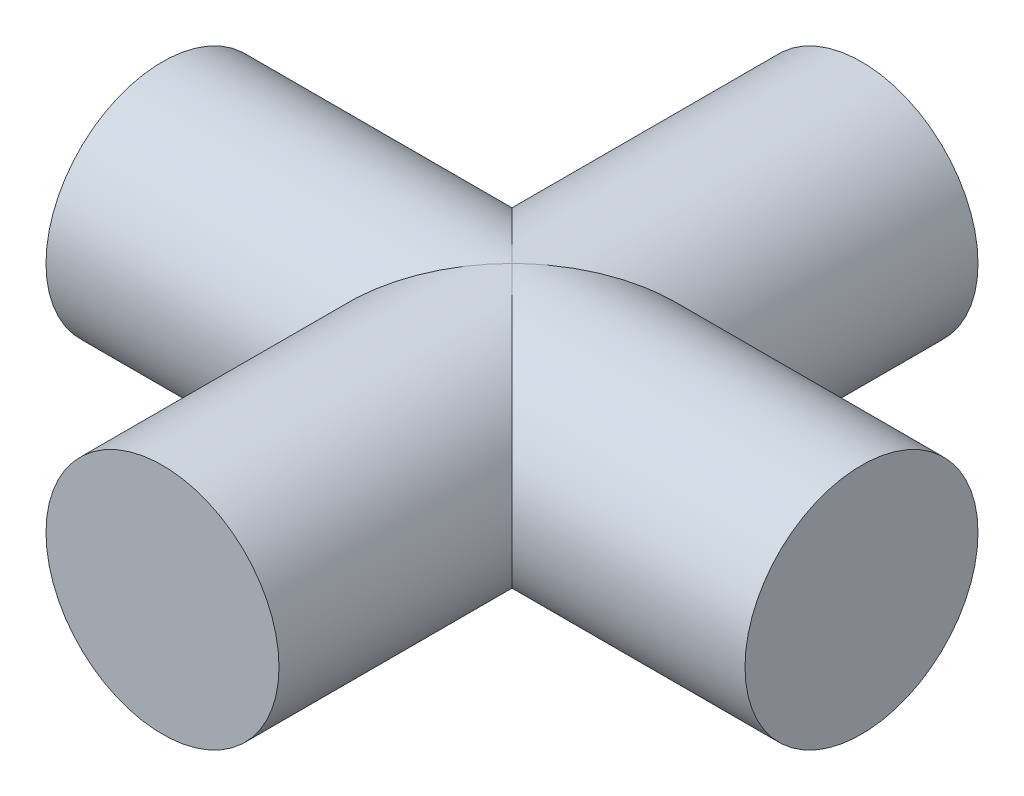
ISO-10303-21;
HEADER;
FILE_DESCRIPTION(('STEP AP214'),'2;1');
FILE_NAME('part.step','',(''),(''),'','','');
FILE_SCHEMA(('AUTOMOTIVE_DESIGN { 1 0 10303 214 1 1 1 1 }'));
ENDSEC;
DATA;
#1=APPLICATION_CONTEXT('core data for automotive mechanical design processes');
#2=APPLICATION_PROTOCOL_DEFINITION('international standard','automotive_design',2000,#1);
#3=PRODUCT_CONTEXT('',#1,'mechanical');
#4=PRODUCT('Part','Part','',(#3));
#5=PRODUCT_RELATED_PRODUCT_CATEGORY('part','',(#4));
#6=PRODUCT_DEFINITION_FORMATION('','',#4);
#7=PRODUCT_DEFINITION_CONTEXT('part definition',#1,'design');
#8=PRODUCT_DEFINITION('design','',#6,#7);
#9=PRODUCT_DEFINITION_SHAPE('','',#8);
#10=(LENGTH_UNIT() NAMED_UNIT(*) SI_UNIT(.MILLI.,.METRE.));
#11=(NAMED_UNIT(*) PLANE_ANGLE_UNIT() SI_UNIT($,.RADIAN.));
#12=(NAMED_UNIT(*) SI_UNIT($,.STERADIAN.) SOLID_ANGLE_UNIT());
#13=UNCERTAINTY_MEASURE_WITH_UNIT(LENGTH_MEASURE(1.E-05),#10,'distance_accuracy_value','');
#14=(GEOMETRIC_REPRESENTATION_CONTEXT(3) GLOBAL_UNCERTAINTY_ASSIGNED_CONTEXT((#13)) GLOBAL_UNIT_ASSIGNED_CONTEXT((#10,
#11,#12)) REPRESENTATION_CONTEXT('',''));
#15=CARTESIAN_POINT('',(0.,0.,0.));
#16=DIRECTION('',(0.,0.,1.));
#17=DIRECTION('',(1.,0.,0.));
#18=AXIS2_PLACEMENT_3D('',#15,#16,#17);
#19=CARTESIAN_POINT('',(-19.05,0.,0.));
#20=DIRECTION('',(1.,0.,0.));
#21=DIRECTION('',(0.,0.,-1.));
#22=AXIS2_PLACEMENT_3D('',#19,#20,#21);
#23=CYLINDRICAL_SURFACE('',#22,6.35);
#24=CARTESIAN_POINT('',(0.,0.,0.));
#25=DIRECTION('',(0.707106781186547,0.,0.707106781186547));
#26=DIRECTION('',(0.707106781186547,0.,-0.707106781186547));
#27=AXIS2_PLACEMENT_3D('',#24,#25,#26);
#28=ELLIPSE('',#27,8.98025612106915,6.35);
#29=CARTESIAN_POINT('',(0.,6.35,0.));
#30=VERTEX_POINT('',#29);
#31=CARTESIAN_POINT('',(0.,-6.35,0.));
#32=VERTEX_POINT('',#31);
#33=EDGE_CURVE('E56',#30,#32,#28,.T.);
#34=ORIENTED_EDGE('',*,*,#33,.F.);
#35=CARTESIAN_POINT('',(0.,0.,0.));
#36=DIRECTION('',(0.707106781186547,0.,-0.707106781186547));
#37=DIRECTION('',(0.707106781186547,0.,0.707106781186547));
#38=AXIS2_PLACEMENT_3D('',#35,#36,#37);
#39=ELLIPSE('',#38,8.98025612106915,6.35);
#40=EDGE_CURVE('E68',#32,#30,#39,.T.);
#41=ORIENTED_EDGE('',*,*,#40,.F.);
#42=EDGE_LOOP('',(#34,#41));
#43=FACE_BOUND('',#42,.T.);
#44=CARTESIAN_POINT('',(-19.05,0.,0.));
#45=DIRECTION('',(1.,0.,0.));
#46=DIRECTION('',(0.,0.,-1.));
#47=AXIS2_PLACEMENT_3D('',#44,#45,#46);
#48=CIRCLE('',#47,6.35);
#49=CARTESIAN_POINT('',(-19.05,0.,-6.35));
#50=VERTEX_POINT('',#49);
#51=EDGE_CURVE('E75',#50,#50,#48,.T.);
#52=ORIENTED_EDGE('',*,*,#51,.T.);
#53=EDGE_LOOP('',(#52));
#54=FACE_BOUND('',#53,.T.);
#55=ADVANCED_FACE('F49',(#43,#54),#23,.T.);
#56=CARTESIAN_POINT('',(-19.05,0.,0.));
#57=DIRECTION('',(1.,0.,0.));
#58=DIRECTION('',(0.,0.,-1.));
#59=AXIS2_PLACEMENT_3D('',#56,#57,#58);
#60=PLANE('',#59);
#61=ORIENTED_EDGE('',*,*,#51,.F.);
#62=EDGE_LOOP('',(#61));
#63=FACE_BOUND('',#62,.T.);
#64=ADVANCED_FACE('F98',(#63),#60,.F.);
#65=CARTESIAN_POINT('',(0.,0.,19.05));
#66=DIRECTION('',(0.,0.,1.));
#67=DIRECTION('',(1.,0.,0.));
#68=AXIS2_PLACEMENT_3D('',#65,#66,#67);
#69=PLANE('',#68);
#70=CARTESIAN_POINT('',(0.,0.,19.05));
#71=DIRECTION('',(0.,0.,1.));
#72=DIRECTION('',(1.,0.,0.));
#73=AXIS2_PLACEMENT_3D('',#70,#71,#72);
#74=CIRCLE('',#73,6.35);
#75=CARTESIAN_POINT('',(6.35,0.,19.05));
#76=VERTEX_POINT('',#75);
#77=EDGE_CURVE('E88',#76,#76,#74,.T.);
#78=ORIENTED_EDGE('',*,*,#77,.T.);
#79=EDGE_LOOP('',(#78));
#80=FACE_BOUND('',#79,.T.);
#81=ADVANCED_FACE('F100',(#80),#69,.T.);
#82=CARTESIAN_POINT('',(0.,0.,-19.05));
#83=DIRECTION('',(0.,0.,1.));
#84=DIRECTION('',(1.,0.,0.));
#85=AXIS2_PLACEMENT_3D('',#82,#83,#84);
#86=CYLINDRICAL_SURFACE('',#85,6.35);
#87=ORIENTED_EDGE('',*,*,#77,.F.);
#88=EDGE_LOOP('',(#87));
#89=FACE_BOUND('',#88,.T.);
#90=CARTESIAN_POINT('',(0.,0.,0.));
#91=DIRECTION('',(0.707106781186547,0.,-0.707106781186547));
#92=DIRECTION('',(0.707106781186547,0.,0.707106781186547));
#93=AXIS2_PLACEMENT_3D('',#90,#91,#92);
#94=ELLIPSE('',#93,8.98025612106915,6.35);
#95=EDGE_CURVE('E62',#32,#30,#94,.F.);
#96=ORIENTED_EDGE('',*,*,#95,.T.);
#97=ORIENTED_EDGE('',*,*,#33,.T.);
#98=EDGE_LOOP('',(#96,#97));
#99=FACE_BOUND('',#98,.T.);
#100=ADVANCED_FACE('F77',(#89,#99),#86,.T.);
#101=CARTESIAN_POINT('',(19.05,0.,0.));
#102=DIRECTION('',(1.,0.,0.));
#103=DIRECTION('',(0.,0.,-1.));
#104=AXIS2_PLACEMENT_3D('',#101,#102,#103);
#105=PLANE('',#104);
#106=CARTESIAN_POINT('',(19.05,0.,0.));
#107=DIRECTION('',(1.,0.,0.));
#108=DIRECTION('',(0.,0.,-1.));
#109=AXIS2_PLACEMENT_3D('',#106,#107,#108);
#110=CIRCLE('',#109,6.35);
#111=CARTESIAN_POINT('',(19.05,0.,-6.35));
#112=VERTEX_POINT('',#111);
#113=EDGE_CURVE('E87',#112,#112,#110,.T.);
#114=ORIENTED_EDGE('',*,*,#113,.T.);
#115=EDGE_LOOP('',(#114));
#116=FACE_BOUND('',#115,.T.);
#117=ADVANCED_FACE('F108',(#116),#105,.T.);
#118=CARTESIAN_POINT('',(0.,0.,0.));
#119=DIRECTION('',(0.707106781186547,0.,0.707106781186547));
#120=DIRECTION('',(0.707106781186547,0.,-0.707106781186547));
#121=AXIS2_PLACEMENT_3D('',#118,#119,#120);
#122=ELLIPSE('',#121,8.98025612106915,6.35);
#123=EDGE_CURVE('E13',#30,#32,#122,.F.);
#124=ORIENTED_EDGE('',*,*,#123,.F.);
#125=ORIENTED_EDGE('',*,*,#95,.F.);
#126=EDGE_LOOP('',(#124,#125));
#127=FACE_BOUND('',#126,.T.);
#128=ORIENTED_EDGE('',*,*,#113,.F.);
#129=EDGE_LOOP('',(#128));
#130=FACE_BOUND('',#129,.T.);
#131=ADVANCED_FACE('F73',(#127,#130),#23,.T.);
#132=ORIENTED_EDGE('',*,*,#40,.T.);
#133=ORIENTED_EDGE('',*,*,#123,.T.);
#134=EDGE_LOOP('',(#132,#133));
#135=FACE_BOUND('',#134,.T.);
#136=CARTESIAN_POINT('',(0.,0.,-19.05));
#137=DIRECTION('',(0.,0.,1.));
#138=DIRECTION('',(1.,0.,0.));
#139=AXIS2_PLACEMENT_3D('',#136,#137,#138);
#140=CIRCLE('',#139,6.35);
#141=CARTESIAN_POINT('',(6.35,0.,-19.05));
#142=VERTEX_POINT('',#141);
#143=EDGE_CURVE('E85',#142,#142,#140,.T.);
#144=ORIENTED_EDGE('',*,*,#143,.T.);
#145=EDGE_LOOP('',(#144));
#146=FACE_BOUND('',#145,.T.);
#147=ADVANCED_FACE('F78',(#135,#146),#86,.T.);
#148=CARTESIAN_POINT('',(0.,0.,-19.05));
#149=DIRECTION('',(0.,0.,1.));
#150=DIRECTION('',(1.,0.,0.));
#151=AXIS2_PLACEMENT_3D('',#148,#149,#150);
#152=PLANE('',#151);
#153=ORIENTED_EDGE('',*,*,#143,.F.);
#154=EDGE_LOOP('',(#153));
#155=FACE_BOUND('',#154,.T.);
#156=ADVANCED_FACE('F81',(#155),#152,.F.);
#157=CLOSED_SHELL('',(#55,#64,#81,#100,#117,#131,#147,#156));
#158=MANIFOLD_SOLID_BREP('B2',#157);
#159=ADVANCED_BREP_SHAPE_REPRESENTATION('',(#18,#158),#14);
#160=SHAPE_DEFINITION_REPRESENTATION(#9,#159);
ENDSEC;
END-ISO-10303-21;
